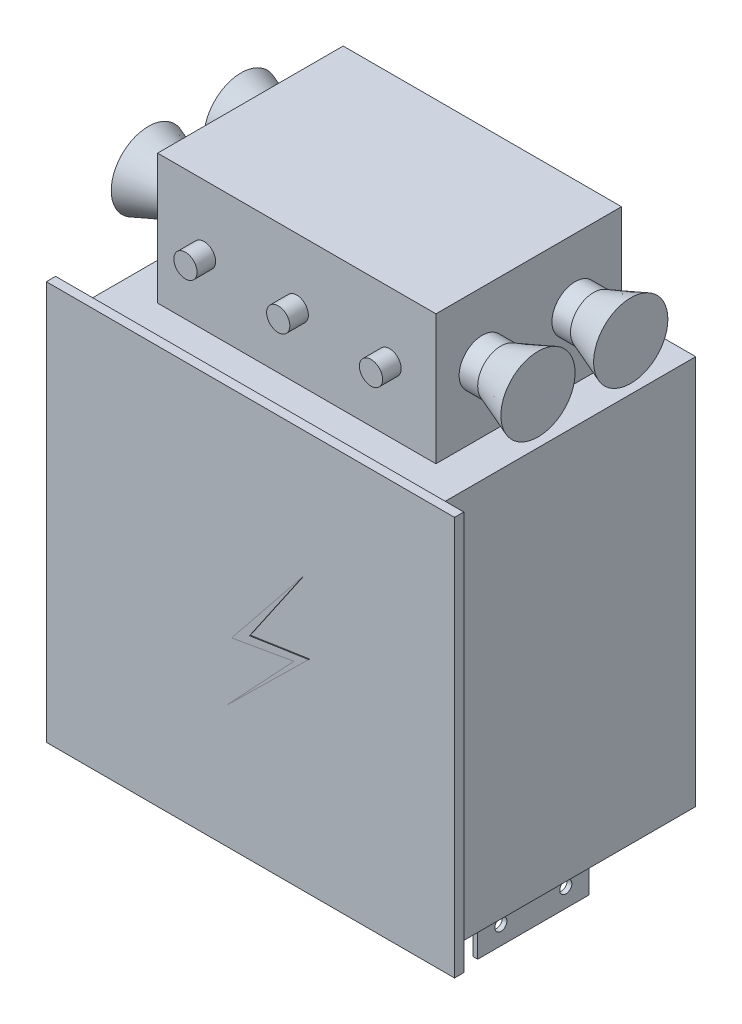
from build123d import *

# Parameters (mm, degrees)
SKETCH_1_W          = 380
SKETCH_1_H          = 420
EXTRUDE_1_DEPTH     = 140
SKETCH_2_W          = 440
SKETCH_2_H          = 430
EXTRUDE_2_DEPTH     = 10
SKETCH_3_W          = 300
SKETCH_3_H          = 200
EXTRUDE_3_DEPTH     = 140
EXTRUDE_4_DEPTH     = 1
SKETCH_6_R          = 12.5
EXTRUDE_5_DEPTH     = 20
SKETCH_7_W          = 5
SKETCH_7_H          = 120
EXTRUDE_6_DEPTH     = 50
SKETCH_8_R          = 6.5
CUT_EXTRUDE_1_DEPTH = 100


with BuildPart() as part:
    # Sketch 1 → Extrude 1 (new, symmetric)
    with BuildSketch(Plane.XY):
        Rectangle(SKETCH_1_W, SKETCH_1_H)
    extrude(amount=EXTRUDE_1_DEPTH, both=True)

    # Sketch 2 → Extrude 2 (add)
    with BuildSketch(Plane.XY.offset(140)):
        with Locations((0, 5)):
            Rectangle(SKETCH_2_W, SKETCH_2_H)
    extrude(amount=EXTRUDE_2_DEPTH)

    # Sketch 3 → Extrude 3 (add)
    with BuildSketch(Plane(origin=(0, 210, 0), x_dir=(-1, 0, 0), z_dir=(0, 1, 0))):
        Rectangle(SKETCH_3_W, SKETCH_3_H)
    extrude(amount=EXTRUDE_3_DEPTH)

    # Sketch 4 → Extrude 4 (add)
    with BuildSketch(Plane.XY.offset(150)):
        Polygon((57.646426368, 84.083259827), (0, 0), (63.838941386, 9.656664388), (-25.025047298, -77.597027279), (47.786088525, 0), (-19.226478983, -11.607689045), align=None)
    extrude(amount=EXTRUDE_4_DEPTH)

    # Sketch 5 → Revolve 1 (revolve)
    with BuildSketch(Plane.XY.offset(50), mode=Mode.PRIVATE) as revolve_1_sk:
        Polygon((150, 280), (150, 305), (170, 305), (210, 320), (210, 280), align=None)
    revolve_1 = revolve(revolve_1_sk.sketch.rotate(Axis((-122.319461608, 280, 50), (1, 0, 0)), 90), axis=Axis((-122.319461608, 280, 50), (1, 0, 0)))

    # Mirror 1: Revolve 1 across plane
    add(revolve_1.mirror(Plane.XY))

    # Mirror 2: Revolve 1 across plane
    add(revolve_1.mirror(Plane(origin=(0, 0, 0), x_dir=(0, 0, 1), z_dir=(1, 0, 0))))

    # Mirror 2 copy 1 sketch → Mirror 2 copy 1 (revolve)
    with BuildSketch(Plane(origin=(0, 0, -50), x_dir=(-1, 0, 0), z_dir=(0, 0, -1))):
        Polygon((150, 280), (150, 305), (170, 305), (210, 320), (210, 280), align=None)
    revolve(axis=Axis((122.319461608, 280, -50), (-1, 0, 0)))

    # Sketch 6 → Extrude 5 (add)
    with BuildSketch(Plane.XY.offset(100)):
        with Locations(Location((-100, 280, 0), (0, 0, 180))):
            Circle(SKETCH_6_R)
        with Locations(Location((0, 280, 0), (0, 0, 180))):
            Circle(SKETCH_6_R)
        with Locations(Location((100, 280, 0), (0, 0, 180))):
            Circle(SKETCH_6_R)
    extrude(amount=EXTRUDE_5_DEPTH)

    # Sketch 7 → Extrude 6 (add)
    with BuildSketch(Plane.XZ.offset(210)):
        with Locations((162.5, 10)):
            Rectangle(SKETCH_7_W, SKETCH_7_H)
    extrude_6 = extrude(amount=EXTRUDE_6_DEPTH)

    # Sketch 8 → Cut-Extrude 1 (cut)
    with BuildSketch(Plane(origin=(165, 0, 0), x_dir=(0, 0, -1), z_dir=(1, 0, 0))):
        with Locations((-45, -240)):
            Circle(SKETCH_8_R)
        with Locations((25, -240)):
            Circle(SKETCH_8_R)
    cut_extrude_1 = extrude(amount=-CUT_EXTRUDE_1_DEPTH, mode=Mode.SUBTRACT)

    # Mirror 3: Extrude 6, Cut-Extrude 1 across plane
    add(extrude_6.mirror(Plane(origin=(0, 0, 0), x_dir=(0, 0, 1), z_dir=(1, 0, 0))))
    add(cut_extrude_1.mirror(Plane(origin=(0, 0, 0), x_dir=(0, 0, 1), z_dir=(1, 0, 0))), mode=Mode.SUBTRACT)


solid = part.part
